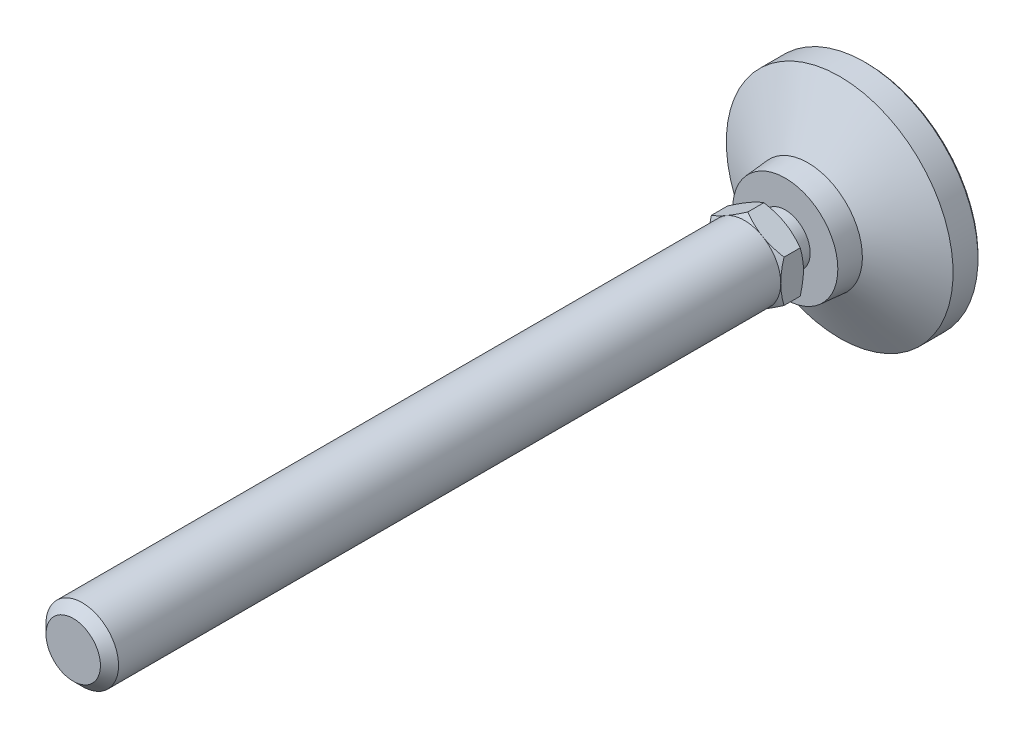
ISO-10303-21;
HEADER;
FILE_DESCRIPTION(('STEP AP214'),'2;1');
FILE_NAME('part.step','',(''),(''),'','','');
FILE_SCHEMA(('AUTOMOTIVE_DESIGN { 1 0 10303 214 1 1 1 1 }'));
ENDSEC;
DATA;
#1=APPLICATION_CONTEXT('core data for automotive mechanical design processes');
#2=APPLICATION_PROTOCOL_DEFINITION('international standard','automotive_design',2000,#1);
#3=PRODUCT_CONTEXT('',#1,'mechanical');
#4=PRODUCT('Part','Part','',(#3));
#5=PRODUCT_RELATED_PRODUCT_CATEGORY('part','',(#4));
#6=PRODUCT_DEFINITION_FORMATION('','',#4);
#7=PRODUCT_DEFINITION_CONTEXT('part definition',#1,'design');
#8=PRODUCT_DEFINITION('design','',#6,#7);
#9=PRODUCT_DEFINITION_SHAPE('','',#8);
#10=(LENGTH_UNIT() NAMED_UNIT(*) SI_UNIT(.MILLI.,.METRE.));
#11=(NAMED_UNIT(*) PLANE_ANGLE_UNIT() SI_UNIT($,.RADIAN.));
#12=(NAMED_UNIT(*) SI_UNIT($,.STERADIAN.) SOLID_ANGLE_UNIT());
#13=UNCERTAINTY_MEASURE_WITH_UNIT(LENGTH_MEASURE(1.E-05),#10,'distance_accuracy_value','');
#14=(GEOMETRIC_REPRESENTATION_CONTEXT(3) GLOBAL_UNCERTAINTY_ASSIGNED_CONTEXT((#13)) GLOBAL_UNIT_ASSIGNED_CONTEXT((#10,
#11,#12)) REPRESENTATION_CONTEXT('',''));
#15=CARTESIAN_POINT('',(0.,0.,0.));
#16=DIRECTION('',(0.,0.,1.));
#17=DIRECTION('',(1.,0.,0.));
#18=AXIS2_PLACEMENT_3D('',#15,#16,#17);
#19=CARTESIAN_POINT('',(0.,-5.50000000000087,21.9999999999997));
#20=DIRECTION('',(0.,0.,-1.));
#21=DIRECTION('',(0.,1.,0.));
#22=AXIS2_PLACEMENT_3D('',#19,#20,#21);
#23=PLANE('',#22);
#24=CARTESIAN_POINT('',(0.,0.,21.9999999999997));
#25=DIRECTION('',(0.,0.,-1.));
#26=DIRECTION('',(0.,1.,0.));
#27=AXIS2_PLACEMENT_3D('',#24,#25,#26);
#28=CIRCLE('',#27,8.00000000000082);
#29=CARTESIAN_POINT('',(-4.00000000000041,6.92820323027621,21.9999999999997));
#30=VERTEX_POINT('',#29);
#31=CARTESIAN_POINT('',(-8.00000000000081,0.,21.9999999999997));
#32=VERTEX_POINT('',#31);
#33=EDGE_CURVE('E9',#30,#32,#28,.F.);
#34=ORIENTED_EDGE('',*,*,#33,.F.);
#35=CARTESIAN_POINT('',(4.,6.92820323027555,21.9999999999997));
#36=VERTEX_POINT('',#35);
#37=EDGE_CURVE('E18',#36,#30,#28,.F.);
#38=ORIENTED_EDGE('',*,*,#37,.F.);
#39=CARTESIAN_POINT('',(8.00000000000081,0.,21.9999999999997));
#40=VERTEX_POINT('',#39);
#41=EDGE_CURVE('E125',#40,#36,#28,.F.);
#42=ORIENTED_EDGE('',*,*,#41,.F.);
#43=CARTESIAN_POINT('',(0.,0.,21.9999999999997));
#44=DIRECTION('',(0.,0.,1.));
#45=DIRECTION('',(0.,-1.,0.));
#46=AXIS2_PLACEMENT_3D('',#43,#44,#45);
#47=CIRCLE('',#46,8.00000000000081);
#48=CARTESIAN_POINT('',(4.00000000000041,-6.92820323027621,21.9999999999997));
#49=VERTEX_POINT('',#48);
#50=EDGE_CURVE('E592',#49,#40,#47,.T.);
#51=ORIENTED_EDGE('',*,*,#50,.F.);
#52=CARTESIAN_POINT('',(-4.00000000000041,-6.92820323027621,21.9999999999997));
#53=VERTEX_POINT('',#52);
#54=EDGE_CURVE('E594',#53,#49,#28,.F.);
#55=ORIENTED_EDGE('',*,*,#54,.F.);
#56=EDGE_CURVE('E23',#32,#53,#28,.F.);
#57=ORIENTED_EDGE('',*,*,#56,.F.);
#58=EDGE_LOOP('',(#34,#38,#42,#51,#55,#57));
#59=FACE_BOUND('',#58,.T.);
#60=CARTESIAN_POINT('',(0.,0.,21.9999999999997));
#61=DIRECTION('',(0.,0.,-1.));
#62=DIRECTION('',(0.,1.,0.));
#63=AXIS2_PLACEMENT_3D('',#60,#61,#62);
#64=CIRCLE('',#63,5.50000000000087);
#65=CARTESIAN_POINT('',(0.,5.50000000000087,21.9999999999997));
#66=VERTEX_POINT('',#65);
#67=EDGE_CURVE('E232',#66,#66,#64,.T.);
#68=ORIENTED_EDGE('',*,*,#67,.F.);
#69=EDGE_LOOP('',(#68));
#70=FACE_BOUND('',#69,.T.);
#71=ADVANCED_FACE('F14',(#59,#70),#23,.T.);
#72=CARTESIAN_POINT('',(0.,0.,-1.));
#73=DIRECTION('',(0.,0.,-1.));
#74=DIRECTION('',(0.,1.,0.));
#75=AXIS2_PLACEMENT_3D('',#72,#73,#74);
#76=CYLINDRICAL_SURFACE('',#75,5.50000000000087);
#77=CARTESIAN_POINT('',(0.,0.,18.));
#78=DIRECTION('',(0.,0.,-1.));
#79=DIRECTION('',(0.,1.,0.));
#80=AXIS2_PLACEMENT_3D('',#77,#78,#79);
#81=CIRCLE('',#80,5.50000000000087);
#82=CARTESIAN_POINT('',(0.,5.50000000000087,18.));
#83=VERTEX_POINT('',#82);
#84=EDGE_CURVE('E235',#83,#83,#81,.T.);
#85=ORIENTED_EDGE('',*,*,#84,.F.);
#86=EDGE_LOOP('',(#85));
#87=FACE_BOUND('',#86,.T.);
#88=ORIENTED_EDGE('',*,*,#67,.T.);
#89=EDGE_LOOP('',(#88));
#90=FACE_BOUND('',#89,.T.);
#91=ADVANCED_FACE('F288',(#87,#90),#76,.T.);
#92=CARTESIAN_POINT('',(0.,-5.50000000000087,18.));
#93=DIRECTION('',(0.,0.,1.));
#94=DIRECTION('',(0.,-1.,0.));
#95=AXIS2_PLACEMENT_3D('',#92,#93,#94);
#96=PLANE('',#95);
#97=ORIENTED_EDGE('',*,*,#84,.T.);
#98=EDGE_LOOP('',(#97));
#99=FACE_BOUND('',#98,.T.);
#100=CARTESIAN_POINT('',(0.,0.,18.));
#101=DIRECTION('',(0.,0.,1.));
#102=DIRECTION('',(0.,-1.,0.));
#103=AXIS2_PLACEMENT_3D('',#100,#101,#102);
#104=CIRCLE('',#103,11.5833333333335);
#105=CARTESIAN_POINT('',(0.,-11.5833333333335,18.));
#106=VERTEX_POINT('',#105);
#107=EDGE_CURVE('E238',#106,#106,#104,.T.);
#108=ORIENTED_EDGE('',*,*,#107,.T.);
#109=EDGE_LOOP('',(#108));
#110=FACE_BOUND('',#109,.T.);
#111=ADVANCED_FACE('F281',(#99,#110),#96,.T.);
#112=CARTESIAN_POINT('',(0.,0.,0.));
#113=DIRECTION('',(0.,0.,-1.));
#114=DIRECTION('',(0.,1.,0.));
#115=AXIS2_PLACEMENT_3D('',#112,#113,#114);
#116=PLANE('',#115);
#117=CARTESIAN_POINT('',(0.,0.,0.));
#118=DIRECTION('',(0.,0.,-1.));
#119=DIRECTION('',(0.,1.,0.));
#120=AXIS2_PLACEMENT_3D('',#117,#118,#119);
#121=CIRCLE('',#120,24.5);
#122=CARTESIAN_POINT('',(0.,24.5,0.));
#123=VERTEX_POINT('',#122);
#124=EDGE_CURVE('E267',#123,#123,#121,.T.);
#125=ORIENTED_EDGE('',*,*,#124,.T.);
#126=EDGE_LOOP('',(#125));
#127=FACE_BOUND('',#126,.T.);
#128=ADVANCED_FACE('F199',(#127),#116,.T.);
#129=CARTESIAN_POINT('',(0.,0.,-1.));
#130=DIRECTION('',(0.,0.,-1.));
#131=DIRECTION('',(0.,1.,0.));
#132=AXIS2_PLACEMENT_3D('',#129,#130,#131);
#133=CYLINDRICAL_SURFACE('',#132,25.);
#134=CARTESIAN_POINT('',(0.,0.,0.500000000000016));
#135=DIRECTION('',(0.,0.,-1.));
#136=DIRECTION('',(0.,1.,0.));
#137=AXIS2_PLACEMENT_3D('',#134,#135,#136);
#138=CIRCLE('',#137,25.);
#139=CARTESIAN_POINT('',(0.,25.,0.500000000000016));
#140=VERTEX_POINT('',#139);
#141=EDGE_CURVE('E126',#140,#140,#138,.F.);
#142=ORIENTED_EDGE('',*,*,#141,.T.);
#143=EDGE_LOOP('',(#142));
#144=FACE_BOUND('',#143,.T.);
#145=CARTESIAN_POINT('',(0.,0.,5.9999999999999));
#146=DIRECTION('',(0.,0.,-1.));
#147=DIRECTION('',(0.,1.,0.));
#148=AXIS2_PLACEMENT_3D('',#145,#146,#147);
#149=CIRCLE('',#148,25.);
#150=CARTESIAN_POINT('',(0.,25.,5.9999999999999));
#151=VERTEX_POINT('',#150);
#152=EDGE_CURVE('E241',#151,#151,#149,.T.);
#153=ORIENTED_EDGE('',*,*,#152,.T.);
#154=EDGE_LOOP('',(#153));
#155=FACE_BOUND('',#154,.T.);
#156=ADVANCED_FACE('F272',(#144,#155),#133,.T.);
#157=CARTESIAN_POINT('',(0.,0.,13.));
#158=DIRECTION('',(0.,0.,-1.));
#159=DIRECTION('',(0.,1.,0.));
#160=AXIS2_PLACEMENT_3D('',#157,#158,#159);
#161=CONICAL_SURFACE('',#160,12.0000000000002,1.07685495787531);
#162=ORIENTED_EDGE('',*,*,#152,.F.);
#163=EDGE_LOOP('',(#162));
#164=FACE_BOUND('',#163,.T.);
#165=CARTESIAN_POINT('',(0.,0.,13.));
#166=DIRECTION('',(0.,0.,-1.));
#167=DIRECTION('',(0.,1.,0.));
#168=AXIS2_PLACEMENT_3D('',#165,#166,#167);
#169=CIRCLE('',#168,12.0000000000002);
#170=CARTESIAN_POINT('',(0.,12.0000000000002,13.));
#171=VERTEX_POINT('',#170);
#172=EDGE_CURVE('E257',#171,#171,#169,.T.);
#173=ORIENTED_EDGE('',*,*,#172,.T.);
#174=EDGE_LOOP('',(#173));
#175=FACE_BOUND('',#174,.T.);
#176=ADVANCED_FACE('F287',(#164,#175),#161,.T.);
#177=CARTESIAN_POINT('',(0.,0.,19.));
#178=DIRECTION('',(0.,0.,-1.));
#179=DIRECTION('',(0.,1.,0.));
#180=AXIS2_PLACEMENT_3D('',#177,#178,#179);
#181=CONICAL_SURFACE('',#180,11.5000000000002,0.0831412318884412);
#182=ORIENTED_EDGE('',*,*,#172,.F.);
#183=EDGE_LOOP('',(#182));
#184=FACE_BOUND('',#183,.T.);
#185=ORIENTED_EDGE('',*,*,#107,.F.);
#186=EDGE_LOOP('',(#185));
#187=FACE_BOUND('',#186,.T.);
#188=ADVANCED_FACE('F277',(#184,#187),#181,.T.);
#189=CARTESIAN_POINT('',(0.,0.,0.));
#190=DIRECTION('',(0.,0.,1.));
#191=DIRECTION('',(0.,-1.,0.));
#192=AXIS2_PLACEMENT_3D('',#189,#190,#191);
#193=CONICAL_SURFACE('',#192,24.5,0.785398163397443);
#194=ORIENTED_EDGE('',*,*,#141,.F.);
#195=EDGE_LOOP('',(#194));
#196=FACE_BOUND('',#195,.T.);
#197=ORIENTED_EDGE('',*,*,#124,.F.);
#198=EDGE_LOOP('',(#197));
#199=FACE_BOUND('',#198,.T.);
#200=ADVANCED_FACE('F16',(#196,#199),#193,.T.);
#201=CARTESIAN_POINT('',(0.,0.,21.9999999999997));
#202=DIRECTION('',(0.,0.,1.));
#203=DIRECTION('',(0.,-1.,0.));
#204=AXIS2_PLACEMENT_3D('',#201,#202,#203);
#205=CONICAL_SURFACE('',#204,8.00000000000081,1.0471975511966);
#206=CARTESIAN_POINT('',(-8.0002,4.61868668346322,22.7145978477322));
#207=CARTESIAN_POINT('',(-7.8243512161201,4.72021302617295,22.6559907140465));
#208=CARTESIAN_POINT('',(-7.64784680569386,4.8221178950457,22.6000434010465));
#209=CARTESIAN_POINT('',(-7.29340453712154,5.02675523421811,22.4942010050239));
#210=CARTESIAN_POINT('',(-7.11546609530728,5.12948804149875,22.4443085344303));
#211=CARTESIAN_POINT('',(-6.57880176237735,5.43933133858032,22.3046927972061));
#212=CARTESIAN_POINT('',(-6.21795741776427,5.64766491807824,22.2252811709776));
#213=CARTESIAN_POINT('',(-5.67796082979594,5.95943209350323,22.1321616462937));
#214=CARTESIAN_POINT('',(-5.50042181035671,6.06193429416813,22.1056345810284));
#215=CARTESIAN_POINT('',(-5.14454088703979,6.26740224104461,22.0611531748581));
#216=CARTESIAN_POINT('',(-4.96619905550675,6.37036794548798,22.0431980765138));
#217=CARTESIAN_POINT('',(-4.6092083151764,6.57647664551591,22.0163156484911));
#218=CARTESIAN_POINT('',(-4.43055998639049,6.67961930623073,22.0073780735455));
#219=CARTESIAN_POINT('',(-4.07309829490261,6.88599991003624,21.9987223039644));
#220=CARTESIAN_POINT('',(-3.89428493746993,6.9892378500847,21.9990038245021));
#221=CARTESIAN_POINT('',(-3.55998663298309,7.18224506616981,22.008145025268));
#222=CARTESIAN_POINT('',(-3.40447809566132,7.27202796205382,22.0158896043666));
#223=CARTESIAN_POINT('',(-3.09382523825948,7.45138347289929,22.0382011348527));
#224=CARTESIAN_POINT('',(-2.93868094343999,7.54095607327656,22.0527685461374));
#225=CARTESIAN_POINT('',(-2.47384868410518,7.80932710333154,22.1063606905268));
#226=CARTESIAN_POINT('',(-2.16498351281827,7.98765049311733,22.1552686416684));
#227=CARTESIAN_POINT('',(-1.54397677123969,8.3461889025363,22.2775394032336));
#228=CARTESIAN_POINT('',(-1.23191445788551,8.52635816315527,22.3514205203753));
#229=CARTESIAN_POINT('',(-0.61244351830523,8.8840098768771,22.5191001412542));
#230=CARTESIAN_POINT('',(-0.305026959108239,9.06149691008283,22.6128592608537));
#231=CARTESIAN_POINT('',(0.000200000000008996,9.23771977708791,22.7145978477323));
#232=B_SPLINE_CURVE_WITH_KNOTS('',3,(#206,#207,#208,#209,#210,#211,#212,#213,#214,#215,#216,
#217,#218,#219,#220,#221,#222,#223,#224,#225,#226,#227,#228,#229,#230,#231),.UNSPECIFIED.,.F.,
.F.,(4,2,2,2,2,2,2,2,2,2,2,2,4),(0.,0.633973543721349,1.26821965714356,2.53934712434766,
3.15934343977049,3.77928496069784,4.39852133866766,5.01773858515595,5.55680239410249,
6.09590254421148,7.17487077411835,8.27776850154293,9.37850115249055),.UNSPECIFIED.);
#233=CARTESIAN_POINT('',(0.,9.23760430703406,22.7145311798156));
#234=VERTEX_POINT('',#233);
#235=EDGE_CURVE('E115',#30,#234,#232,.T.);
#236=ORIENTED_EDGE('',*,*,#235,.T.);
#237=CARTESIAN_POINT('',(-0.000199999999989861,9.2377197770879,22.7145978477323));
#238=CARTESIAN_POINT('',(0.175648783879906,9.13619343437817,22.6559907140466));
#239=CARTESIAN_POINT('',(0.352153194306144,9.03428856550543,22.6000434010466));
#240=CARTESIAN_POINT('',(0.70659546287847,8.82965122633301,22.4942010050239));
#241=CARTESIAN_POINT('',(0.884533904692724,8.72691841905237,22.4443085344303));
#242=CARTESIAN_POINT('',(1.42119823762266,8.4170751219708,22.3046927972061));
#243=CARTESIAN_POINT('',(1.78204258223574,8.20874154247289,22.2252811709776));
#244=CARTESIAN_POINT('',(2.32203917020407,7.89697436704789,22.1321616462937));
#245=CARTESIAN_POINT('',(2.49957818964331,7.79447216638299,22.1056345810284));
#246=CARTESIAN_POINT('',(2.85545911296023,7.58900421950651,22.0611531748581));
#247=CARTESIAN_POINT('',(3.03380094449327,7.48603851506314,22.0431980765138));
#248=CARTESIAN_POINT('',(3.39079168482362,7.27992981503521,22.0163156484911));
#249=CARTESIAN_POINT('',(3.56944001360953,7.17678715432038,22.0073780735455));
#250=CARTESIAN_POINT('',(3.92690170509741,6.97040655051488,21.9987223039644));
#251=CARTESIAN_POINT('',(4.1057150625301,6.86716861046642,21.9990038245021));
#252=CARTESIAN_POINT('',(4.44001336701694,6.67416139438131,22.008145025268));
#253=CARTESIAN_POINT('',(4.5955219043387,6.5843784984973,22.0158896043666));
#254=CARTESIAN_POINT('',(4.90617476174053,6.40502298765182,22.0382011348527));
#255=CARTESIAN_POINT('',(5.06131905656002,6.31545038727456,22.0527685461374));
#256=CARTESIAN_POINT('',(5.52615131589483,6.04707935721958,22.1063606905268));
#257=CARTESIAN_POINT('',(5.83501648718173,5.86875596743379,22.1552686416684));
#258=CARTESIAN_POINT('',(6.4560232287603,5.51021755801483,22.2775394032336));
#259=CARTESIAN_POINT('',(6.76808554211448,5.33004829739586,22.3514205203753));
#260=CARTESIAN_POINT('',(7.38755648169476,4.97239658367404,22.5191001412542));
#261=CARTESIAN_POINT('',(7.69497304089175,4.79490955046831,22.6128592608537));
#262=CARTESIAN_POINT('',(8.0002,4.61868668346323,22.7145978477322));
#263=B_SPLINE_CURVE_WITH_KNOTS('',3,(#237,#238,#239,#240,#241,#242,#243,#244,#245,#246,#247,
#248,#249,#250,#251,#252,#253,#254,#255,#256,#257,#258,#259,#260,#261,#262),.UNSPECIFIED.,.F.,
.F.,(4,2,2,2,2,2,2,2,2,2,2,2,4),(0.,0.633973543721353,1.26821965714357,2.53934712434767,
3.15934343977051,3.77928496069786,4.39852133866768,5.01773858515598,5.55680239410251,
6.09590254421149,7.17487077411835,8.27776850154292,9.37850115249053),.UNSPECIFIED.);
#264=EDGE_CURVE('E121',#234,#36,#263,.T.);
#265=ORIENTED_EDGE('',*,*,#264,.T.);
#266=ORIENTED_EDGE('',*,*,#37,.T.);
#267=EDGE_LOOP('',(#236,#265,#266));
#268=FACE_BOUND('',#267,.T.);
#269=ADVANCED_FACE('F119',(#268),#205,.T.);
#270=CARTESIAN_POINT('',(8.,12.3789060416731,25.890747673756));
#271=CARTESIAN_POINT('',(8.,12.0297316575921,25.7214786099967));
#272=CARTESIAN_POINT('',(8.,11.6797527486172,25.5538405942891));
#273=CARTESIAN_POINT('',(8.,10.9777579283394,25.2227445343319));
#274=CARTESIAN_POINT('',(8.,10.6257417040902,25.0592871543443));
#275=CARTESIAN_POINT('',(8.,9.91741719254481,24.7366419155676));
#276=CARTESIAN_POINT('',(8.,9.5610959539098,24.5774823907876));
#277=CARTESIAN_POINT('',(8.,8.84560981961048,24.2657136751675));
#278=CARTESIAN_POINT('',(8.,8.48644506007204,24.1131041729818));
#279=CARTESIAN_POINT('',(8.,7.75320140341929,23.8114348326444));
#280=CARTESIAN_POINT('',(8.,7.37901174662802,23.6626427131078));
#281=CARTESIAN_POINT('',(8.,6.62624528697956,23.3763869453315));
#282=CARTESIAN_POINT('',(8.,6.24766799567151,23.2389245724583));
#283=CARTESIAN_POINT('',(8.,5.48623705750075,22.9789578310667));
#284=CARTESIAN_POINT('',(8.,5.10339394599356,22.8564229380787));
#285=CARTESIAN_POINT('',(8.,4.33222994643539,22.630259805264));
#286=CARTESIAN_POINT('',(8.,3.94391083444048,22.5266255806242));
#287=CARTESIAN_POINT('',(8.,3.16366689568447,22.3438140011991));
#288=CARTESIAN_POINT('',(8.,2.77177385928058,22.2645046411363));
#289=CARTESIAN_POINT('',(8.,2.1803878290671,22.1672300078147));
#290=CARTESIAN_POINT('',(8.,1.9826533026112,22.1384187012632));
#291=CARTESIAN_POINT('',(8.,1.58621087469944,22.088591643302));
#292=CARTESIAN_POINT('',(8.,1.38750306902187,22.0675751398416));
#293=CARTESIAN_POINT('',(8.,0.991963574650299,22.0340185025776));
#294=CARTESIAN_POINT('',(8.,0.795140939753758,22.0213720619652));
#295=CARTESIAN_POINT('',(8.,0.401137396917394,22.0044118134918));
#296=CARTESIAN_POINT('',(8.,0.20395649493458,22.0000978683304));
#297=CARTESIAN_POINT('',(8.,-0.190411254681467,21.9999054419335));
#298=CARTESIAN_POINT('',(8.,-0.387598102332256,22.0040269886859));
#299=CARTESIAN_POINT('',(8.,-0.781623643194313,22.0206052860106));
#300=CARTESIAN_POINT('',(8.,-0.978462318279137,22.0330624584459));
#301=CARTESIAN_POINT('',(8.,-1.45238232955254,22.0728273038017));
#302=CARTESIAN_POINT('',(8.,-1.7291348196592,22.1041375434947));
#303=CARTESIAN_POINT('',(8.,-2.28055433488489,22.1815210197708));
#304=CARTESIAN_POINT('',(8.,-2.55522106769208,22.2275962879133));
#305=CARTESIAN_POINT('',(8.,-3.3757971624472,22.3855237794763));
#306=CARTESIAN_POINT('',(8.,-3.91796881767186,22.517047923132));
#307=CARTESIAN_POINT('',(8.,-4.72859747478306,22.7447233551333));
#308=CARTESIAN_POINT('',(8.,-5.00126963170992,22.8267266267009));
#309=CARTESIAN_POINT('',(8.,-5.54396501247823,22.9991521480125));
#310=CARTESIAN_POINT('',(8.,-5.81398821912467,23.0895744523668));
#311=CARTESIAN_POINT('',(8.,-6.3514722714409,23.2773954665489));
#312=CARTESIAN_POINT('',(8.,-6.61893395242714,23.3747918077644));
#313=CARTESIAN_POINT('',(8.,-7.151648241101,23.5754247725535));
#314=CARTESIAN_POINT('',(8.,-7.41690087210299,23.6786613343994));
#315=CARTESIAN_POINT('',(8.,-8.03215461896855,23.924676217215));
#316=CARTESIAN_POINT('',(8.,-8.38141006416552,24.0693156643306));
#317=CARTESIAN_POINT('',(8.,-9.07703169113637,24.36540229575));
#318=CARTESIAN_POINT('',(8.,-9.42339770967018,24.516849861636));
#319=CARTESIAN_POINT('',(8.,-10.1137569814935,24.8252167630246));
#320=CARTESIAN_POINT('',(8.,-10.4577497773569,24.982137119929));
#321=CARTESIAN_POINT('',(8.,-11.1436966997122,25.30037981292));
#322=CARTESIAN_POINT('',(8.,-11.4856507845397,25.4617022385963));
#323=CARTESIAN_POINT('',(8.,-12.1681853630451,25.7881024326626));
#324=CARTESIAN_POINT('',(8.,-12.5087641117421,25.9531838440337));
#325=CARTESIAN_POINT('',(8.,-13.1884668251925,26.2863176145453));
#326=CARTESIAN_POINT('',(8.,-13.5275907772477,26.4543699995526));
#327=CARTESIAN_POINT('',(8.,-14.5430364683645,26.9621670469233));
#328=CARTESIAN_POINT('',(8.,-15.2175173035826,27.3055927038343));
#329=CARTESIAN_POINT('',(8.,-16.5081876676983,27.9711854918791));
#330=CARTESIAN_POINT('',(8.,-17.1246578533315,28.2928107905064));
#331=CARTESIAN_POINT('',(8.,-18.3552851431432,28.9405020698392));
#332=CARTESIAN_POINT('',(8.,-18.9694421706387,29.2665681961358));
#333=CARTESIAN_POINT('',(8.,-20.1944810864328,29.9213120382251));
#334=CARTESIAN_POINT('',(8.,-20.8053672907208,30.2499816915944));
#335=CARTESIAN_POINT('',(8.,-22.0256539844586,30.9099920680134));
#336=CARTESIAN_POINT('',(8.,-22.6350545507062,31.2413326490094));
#337=CARTESIAN_POINT('',(8.,-23.2439051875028,31.573673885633));
#338=B_SPLINE_CURVE_WITH_KNOTS('',3,(#270,#271,#272,#273,#274,#275,#276,#277,#278,#279,#280,
#281,#282,#283,#284,#285,#286,#287,#288,#289,#290,#291,#292,#293,#294,#295,#296,#297,#298,#299,
#300,#301,#302,#303,#304,#305,#306,#307,#308,#309,#310,#311,#312,#313,#314,#315,#316,#317,#318,
#319,#320,#321,#322,#323,#324,#325,#326,#327,#328,#329,#330,#331,#332,#333,#334,#335,#336,#337),
.UNSPECIFIED.,.F.,.F.,(4,2,2,2,2,2,2,2,2,2,2,2,2,2,2,2,2,2,2,2,2,2,2,2,2,2,2,2,2,2,2,2,2,4),(0.,
1.16413328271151,2.32845039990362,3.49915341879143,4.66980072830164,5.87772003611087,
7.08577513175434,8.29131692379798,9.49647632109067,10.6949749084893,11.2943129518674,
11.8935931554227,12.4851079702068,13.0766130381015,13.6681200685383,14.2596570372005,
15.0947384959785,15.9299349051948,17.6012685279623,18.4554067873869,19.3095505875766,
20.1634056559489,21.0172517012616,22.1512188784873,23.2852496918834,24.419493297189,
25.553760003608,26.6891771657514,27.8246042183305,30.0951744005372,32.1811332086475,
34.2671605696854,36.3482232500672,38.4291759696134),.UNSPECIFIED.);
#339=CARTESIAN_POINT('',(8.,4.61880215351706,22.7145311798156));
#340=VERTEX_POINT('',#339);
#341=EDGE_CURVE('E134',#340,#40,#338,.T.);
#342=ORIENTED_EDGE('',*,*,#341,.T.);
#343=ORIENTED_EDGE('',*,*,#41,.T.);
#344=EDGE_CURVE('E171',#36,#340,#263,.T.);
#345=ORIENTED_EDGE('',*,*,#344,.T.);
#346=EDGE_LOOP('',(#342,#343,#345));
#347=FACE_BOUND('',#346,.T.);
#348=ADVANCED_FACE('F159',(#347),#205,.T.);
#349=CARTESIAN_POINT('',(8.0002,-4.61868668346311,22.7145978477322));
#350=CARTESIAN_POINT('',(7.82435121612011,-4.72021302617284,22.6559907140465));
#351=CARTESIAN_POINT('',(7.64784680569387,-4.82211789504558,22.6000434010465));
#352=CARTESIAN_POINT('',(7.29340453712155,-5.02675523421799,22.4942010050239));
#353=CARTESIAN_POINT('',(7.11546609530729,-5.12948804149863,22.4443085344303));
#354=CARTESIAN_POINT('',(6.57880176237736,-5.4393313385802,22.3046927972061));
#355=CARTESIAN_POINT('',(6.21795741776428,-5.64766491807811,22.2252811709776));
#356=CARTESIAN_POINT('',(5.67796082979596,-5.95943209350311,22.1321616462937));
#357=CARTESIAN_POINT('',(5.50042181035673,-6.06193429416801,22.1056345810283));
#358=CARTESIAN_POINT('',(5.14454088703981,-6.26740224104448,22.0611531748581));
#359=CARTESIAN_POINT('',(4.96619905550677,-6.37036794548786,22.0431980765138));
#360=CARTESIAN_POINT('',(4.60920831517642,-6.57647664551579,22.0163156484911));
#361=CARTESIAN_POINT('',(4.43055998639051,-6.67961930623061,22.0073780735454));
#362=CARTESIAN_POINT('',(4.07309829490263,-6.88599991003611,21.9987223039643));
#363=CARTESIAN_POINT('',(3.89428493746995,-6.98923785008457,21.999003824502));
#364=CARTESIAN_POINT('',(3.55998663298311,-7.18224506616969,22.008145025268));
#365=CARTESIAN_POINT('',(3.40447809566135,-7.27202796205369,22.0158896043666));
#366=CARTESIAN_POINT('',(3.09382523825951,-7.45138347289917,22.0382011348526));
#367=CARTESIAN_POINT('',(2.93868094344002,-7.54095607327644,22.0527685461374));
#368=CARTESIAN_POINT('',(2.4738486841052,-7.80932710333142,22.1063606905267));
#369=CARTESIAN_POINT('',(2.16498351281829,-7.98765049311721,22.1552686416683));
#370=CARTESIAN_POINT('',(1.54397677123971,-8.34618890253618,22.2775394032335));
#371=CARTESIAN_POINT('',(1.23191445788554,-8.52635816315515,22.3514205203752));
#372=CARTESIAN_POINT('',(0.612443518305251,-8.88400987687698,22.5191001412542));
#373=CARTESIAN_POINT('',(0.305026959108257,-9.06149691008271,22.6128592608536));
#374=CARTESIAN_POINT('',(-0.000199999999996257,-9.23771977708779,22.7145978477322));
#375=B_SPLINE_CURVE_WITH_KNOTS('',3,(#349,#350,#351,#352,#353,#354,#355,#356,#357,#358,#359,
#360,#361,#362,#363,#364,#365,#366,#367,#368,#369,#370,#371,#372,#373,#374),.UNSPECIFIED.,.F.,
.F.,(4,2,2,2,2,2,2,2,2,2,2,2,4),(0.,0.63397354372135,1.26821965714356,2.53934712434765,
3.15934343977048,3.77928496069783,4.39852133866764,5.01773858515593,5.55680239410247,
6.09590254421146,7.17487077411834,8.27776850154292,9.37850115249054),.UNSPECIFIED.);
#376=CARTESIAN_POINT('',(8.,-4.61880215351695,22.7145311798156));
#377=VERTEX_POINT('',#376);
#378=EDGE_CURVE('E149',#377,#49,#375,.T.);
#379=ORIENTED_EDGE('',*,*,#378,.T.);
#380=ORIENTED_EDGE('',*,*,#50,.T.);
#381=EDGE_CURVE('E114',#40,#377,#338,.T.);
#382=ORIENTED_EDGE('',*,*,#381,.T.);
#383=EDGE_LOOP('',(#379,#380,#382));
#384=FACE_BOUND('',#383,.T.);
#385=ADVANCED_FACE('F163',(#384),#205,.T.);
#386=CARTESIAN_POINT('',(0.00020000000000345,-9.23771977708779,22.7145978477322));
#387=CARTESIAN_POINT('',(-0.175648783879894,-9.13619343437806,22.6559907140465));
#388=CARTESIAN_POINT('',(-0.352153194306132,-9.03428856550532,22.6000434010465));
#389=CARTESIAN_POINT('',(-0.706595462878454,-8.8296512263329,22.4942010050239));
#390=CARTESIAN_POINT('',(-0.884533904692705,-8.72691841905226,22.4443085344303));
#391=CARTESIAN_POINT('',(-1.42119823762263,-8.4170751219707,22.3046927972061));
#392=CARTESIAN_POINT('',(-1.78204258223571,-8.20874154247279,22.2252811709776));
#393=CARTESIAN_POINT('',(-2.32203917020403,-7.8969743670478,22.1321616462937));
#394=CARTESIAN_POINT('',(-2.49957818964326,-7.79447216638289,22.1056345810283));
#395=CARTESIAN_POINT('',(-2.85545911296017,-7.58900421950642,22.0611531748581));
#396=CARTESIAN_POINT('',(-3.03380094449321,-7.48603851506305,22.0431980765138));
#397=CARTESIAN_POINT('',(-3.39079168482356,-7.27992981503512,22.0163156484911));
#398=CARTESIAN_POINT('',(-3.56944001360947,-7.1767871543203,22.0073780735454));
#399=CARTESIAN_POINT('',(-3.92690170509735,-6.97040655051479,21.9987223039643));
#400=CARTESIAN_POINT('',(-4.10571506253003,-6.86716861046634,21.999003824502));
#401=CARTESIAN_POINT('',(-4.44001336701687,-6.67416139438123,22.008145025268));
#402=CARTESIAN_POINT('',(-4.59552190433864,-6.58437849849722,22.0158896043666));
#403=CARTESIAN_POINT('',(-4.90617476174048,-6.40502298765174,22.0382011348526));
#404=CARTESIAN_POINT('',(-5.06131905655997,-6.31545038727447,22.0527685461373));
#405=CARTESIAN_POINT('',(-5.52615131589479,-6.04707935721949,22.1063606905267));
#406=CARTESIAN_POINT('',(-5.8350164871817,-5.86875596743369,22.1552686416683));
#407=CARTESIAN_POINT('',(-6.45602322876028,-5.51021755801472,22.2775394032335));
#408=CARTESIAN_POINT('',(-6.76808554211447,-5.33004829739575,22.3514205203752));
#409=CARTESIAN_POINT('',(-7.38755648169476,-4.97239658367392,22.5191001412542));
#410=CARTESIAN_POINT('',(-7.69497304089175,-4.79490955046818,22.6128592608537));
#411=CARTESIAN_POINT('',(-8.0002,-4.6186866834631,22.7145978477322));
#412=B_SPLINE_CURVE_WITH_KNOTS('',3,(#386,#387,#388,#389,#390,#391,#392,#393,#394,#395,#396,
#397,#398,#399,#400,#401,#402,#403,#404,#405,#406,#407,#408,#409,#410,#411),.UNSPECIFIED.,.F.,
.F.,(4,2,2,2,2,2,2,2,2,2,2,2,4),(0.,0.633973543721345,1.26821965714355,2.53934712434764,
3.15934343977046,3.7792849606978,4.39852133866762,5.01773858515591,5.55680239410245,
6.09590254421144,7.17487077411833,8.27776850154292,9.37850115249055),.UNSPECIFIED.);
#413=CARTESIAN_POINT('',(0.,-9.23760430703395,22.7145311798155));
#414=VERTEX_POINT('',#413);
#415=EDGE_CURVE('E37',#414,#53,#412,.T.);
#416=ORIENTED_EDGE('',*,*,#415,.T.);
#417=ORIENTED_EDGE('',*,*,#54,.T.);
#418=EDGE_CURVE('E536',#49,#414,#375,.T.);
#419=ORIENTED_EDGE('',*,*,#418,.T.);
#420=EDGE_LOOP('',(#416,#417,#419));
#421=FACE_BOUND('',#420,.T.);
#422=ADVANCED_FACE('F165',(#421),#205,.T.);
#423=CARTESIAN_POINT('',(-8.,-4.61880215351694,22.7145311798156));
#424=VERTEX_POINT('',#423);
#425=EDGE_CURVE('E186',#53,#424,#412,.T.);
#426=ORIENTED_EDGE('',*,*,#425,.T.);
#427=CARTESIAN_POINT('',(-8.,12.3789060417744,25.8907476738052));
#428=CARTESIAN_POINT('',(-8.,12.0297316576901,25.7214786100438));
#429=CARTESIAN_POINT('',(-8.00000000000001,11.6797527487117,25.5538405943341));
#430=CARTESIAN_POINT('',(-8.00000000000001,10.9777579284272,25.2227445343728));
#431=CARTESIAN_POINT('',(-8.00000000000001,10.6257417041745,25.0592871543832));
#432=CARTESIAN_POINT('',(-8.00000000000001,9.91741719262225,24.7366419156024));
#433=CARTESIAN_POINT('',(-8.00000000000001,9.56109595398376,24.5774823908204));
#434=CARTESIAN_POINT('',(-8.00000000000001,8.84560981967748,24.2657136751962));
#435=CARTESIAN_POINT('',(-8.00000000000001,8.48644506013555,24.1131041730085));
#436=CARTESIAN_POINT('',(-8.00000000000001,7.75320140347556,23.811434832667));
#437=CARTESIAN_POINT('',(-8.00000000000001,7.37901174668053,23.6626427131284));
#438=CARTESIAN_POINT('',(-8.00000000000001,6.62624528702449,23.376386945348));
#439=CARTESIAN_POINT('',(-8.,6.24766799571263,23.2389245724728));
#440=CARTESIAN_POINT('',(-8.,5.48623705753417,22.9789578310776));
#441=CARTESIAN_POINT('',(-8.00000000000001,5.10339394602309,22.8564229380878));
#442=CARTESIAN_POINT('',(-8.,4.33222994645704,22.6302598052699));
#443=CARTESIAN_POINT('',(-8.,3.94391083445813,22.5266255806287));
#444=CARTESIAN_POINT('',(-8.,3.16366689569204,22.3438140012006));
#445=CARTESIAN_POINT('',(-8.,2.77177385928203,22.2645046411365));
#446=CARTESIAN_POINT('',(-8.,2.18038782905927,22.1672300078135));
#447=CARTESIAN_POINT('',(-8.,1.98265330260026,22.1384187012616));
#448=CARTESIAN_POINT('',(-8.,1.58621087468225,22.0885916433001));
#449=CARTESIAN_POINT('',(-8.,1.38750306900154,22.0675751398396));
#450=CARTESIAN_POINT('',(-8.,0.991963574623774,22.0340185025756));
#451=CARTESIAN_POINT('',(-8.,0.795140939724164,22.0213720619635));
#452=CARTESIAN_POINT('',(-8.,0.401137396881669,22.0044118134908));
#453=CARTESIAN_POINT('',(-8.,0.203956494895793,22.0000978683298));
#454=CARTESIAN_POINT('',(-8.,-0.190411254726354,21.9999054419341));
#455=CARTESIAN_POINT('',(-8.,-0.38759810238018,22.0040269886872));
#456=CARTESIAN_POINT('',(-8.,-0.781623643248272,22.0206052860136));
#457=CARTESIAN_POINT('',(-8.,-0.978462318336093,22.0330624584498));
#458=CARTESIAN_POINT('',(-8.,-1.4523823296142,22.072827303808));
#459=CARTESIAN_POINT('',(-8.,-1.72913481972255,22.1041375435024));
#460=CARTESIAN_POINT('',(-8.,-2.28055433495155,22.1815210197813));
#461=CARTESIAN_POINT('',(-8.,-2.55522106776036,22.2275962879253));
#462=CARTESIAN_POINT('',(-8.,-3.37579716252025,22.3855237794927));
#463=CARTESIAN_POINT('',(-8.,-3.91796881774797,22.5170479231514));
#464=CARTESIAN_POINT('',(-8.,-4.72859747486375,22.744723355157));
#465=CARTESIAN_POINT('',(-8.,-5.00126963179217,22.8267266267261));
#466=CARTESIAN_POINT('',(-8.,-5.54396501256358,22.9991521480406));
#467=CARTESIAN_POINT('',(-8.,-5.81398821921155,23.0895744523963));
#468=CARTESIAN_POINT('',(-8.,-6.35147227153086,23.2773954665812));
#469=CARTESIAN_POINT('',(-8.,-6.61893395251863,23.3747918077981));
#470=CARTESIAN_POINT('',(-8.,-7.15164824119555,23.5754247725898));
#471=CARTESIAN_POINT('',(-8.,-7.41690087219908,23.6786613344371));
#472=CARTESIAN_POINT('',(-8.,-8.03215461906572,23.9246762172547));
#473=CARTESIAN_POINT('',(-8.,-8.38141006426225,24.0693156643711));
#474=CARTESIAN_POINT('',(-8.,-9.0770316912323,24.3654022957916));
#475=CARTESIAN_POINT('',(-8.,-9.42339770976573,24.5168498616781));
#476=CARTESIAN_POINT('',(-8.,-10.1137569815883,24.8252167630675));
#477=CARTESIAN_POINT('',(-8.,-10.4577497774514,24.9821371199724));
#478=CARTESIAN_POINT('',(-8.,-11.143696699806,25.300379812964));
#479=CARTESIAN_POINT('',(-8.,-11.4856507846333,25.4617022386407));
#480=CARTESIAN_POINT('',(-8.,-12.1681853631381,25.7881024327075));
#481=CARTESIAN_POINT('',(-8.,-12.5087641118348,25.9531838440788));
#482=CARTESIAN_POINT('',(-8.,-13.1884668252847,26.2863176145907));
#483=CARTESIAN_POINT('',(-8.,-13.5275907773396,26.4543699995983));
#484=CARTESIAN_POINT('',(-8.,-14.5430364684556,26.9621670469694));
#485=CARTESIAN_POINT('',(-8.,-15.2175173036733,27.3055927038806));
#486=CARTESIAN_POINT('',(-8.,-16.5081876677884,27.971185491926));
#487=CARTESIAN_POINT('',(-7.99999999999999,-17.1246578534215,28.2928107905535));
#488=CARTESIAN_POINT('',(-7.99999999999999,-18.3552851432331,28.9405020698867));
#489=CARTESIAN_POINT('',(-7.99999999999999,-18.9694421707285,29.2665681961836));
#490=CARTESIAN_POINT('',(-7.99999999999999,-20.1944810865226,29.9213120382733));
#491=CARTESIAN_POINT('',(-7.99999999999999,-20.8053672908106,30.2499816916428));
#492=CARTESIAN_POINT('',(-7.99999999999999,-22.0256539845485,30.9099920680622));
#493=CARTESIAN_POINT('',(-7.99999999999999,-22.6350545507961,31.2413326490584));
#494=CARTESIAN_POINT('',(-8.,-23.2439051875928,31.5736738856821));
#495=B_SPLINE_CURVE_WITH_KNOTS('',3,(#427,#428,#429,#430,#431,#432,#433,#434,#435,#436,#437,
#438,#439,#440,#441,#442,#443,#444,#445,#446,#447,#448,#449,#450,#451,#452,#453,#454,#455,#456,
#457,#458,#459,#460,#461,#462,#463,#464,#465,#466,#467,#468,#469,#470,#471,#472,#473,#474,#475,
#476,#477,#478,#479,#480,#481,#482,#483,#484,#485,#486,#487,#488,#489,#490,#491,#492,#493,#494),
.UNSPECIFIED.,.F.,.F.,(4,2,2,2,2,2,2,2,2,2,2,2,2,2,2,2,2,2,2,2,2,2,2,2,2,2,2,2,2,2,2,2,2,4),(0.,
1.1641332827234,2.32845039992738,3.49915341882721,4.66980072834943,5.8777200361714,
7.08577513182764,8.29131692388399,9.49647632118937,10.6949749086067,11.2943129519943,
11.8935931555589,12.4851079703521,13.076613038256,13.6681200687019,14.2596570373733,
15.0947384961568,15.9299349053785,17.6012685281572,18.4554067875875,19.3095505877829,
20.1634056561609,21.0172517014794,22.1512188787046,23.2852496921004,24.4194932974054,
25.553760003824,26.6891771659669,27.8246042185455,30.0951744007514,32.1811332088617,
34.2671605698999,36.348223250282,38.4291759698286),.UNSPECIFIED.);
#496=EDGE_CURVE('E30',#424,#32,#495,.F.);
#497=ORIENTED_EDGE('',*,*,#496,.T.);
#498=ORIENTED_EDGE('',*,*,#56,.T.);
#499=EDGE_LOOP('',(#426,#497,#498));
#500=FACE_BOUND('',#499,.T.);
#501=ADVANCED_FACE('F373',(#500),#205,.T.);
#502=CARTESIAN_POINT('',(-8.,4.61880215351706,22.7145311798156));
#503=VERTEX_POINT('',#502);
#504=EDGE_CURVE('E109',#32,#503,#495,.F.);
#505=ORIENTED_EDGE('',*,*,#504,.T.);
#506=EDGE_CURVE('E103',#503,#30,#232,.T.);
#507=ORIENTED_EDGE('',*,*,#506,.T.);
#508=ORIENTED_EDGE('',*,*,#33,.T.);
#509=EDGE_LOOP('',(#505,#507,#508));
#510=FACE_BOUND('',#509,.T.);
#511=ADVANCED_FACE('F105',(#510),#205,.T.);
#512=CARTESIAN_POINT('',(0.,0.,175.));
#513=DIRECTION('',(0.,0.,-1.));
#514=DIRECTION('',(0.,1.,0.));
#515=AXIS2_PLACEMENT_3D('',#512,#513,#514);
#516=PLANE('',#515);
#517=CARTESIAN_POINT('',(0.,0.,175.));
#518=DIRECTION('',(0.,0.,-1.));
#519=DIRECTION('',(0.,1.,0.));
#520=AXIS2_PLACEMENT_3D('',#517,#518,#519);
#521=CIRCLE('',#520,6.00000000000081);
#522=CARTESIAN_POINT('',(0.,6.00000000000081,175.));
#523=VERTEX_POINT('',#522);
#524=EDGE_CURVE('E229',#523,#523,#521,.T.);
#525=ORIENTED_EDGE('',*,*,#524,.F.);
#526=EDGE_LOOP('',(#525));
#527=FACE_BOUND('',#526,.T.);
#528=ADVANCED_FACE('F298',(#527),#516,.F.);
#529=CARTESIAN_POINT('',(0.,0.,175.));
#530=DIRECTION('',(0.,0.,-1.));
#531=DIRECTION('',(0.,1.,0.));
#532=AXIS2_PLACEMENT_3D('',#529,#530,#531);
#533=CONICAL_SURFACE('',#532,6.00000000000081,0.785398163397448);
#534=CARTESIAN_POINT('',(0.,0.,173.));
#535=DIRECTION('',(0.,0.,-1.));
#536=DIRECTION('',(0.,1.,0.));
#537=AXIS2_PLACEMENT_3D('',#534,#535,#536);
#538=CIRCLE('',#537,8.00000000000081);
#539=CARTESIAN_POINT('',(0.,8.00000000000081,173.));
#540=VERTEX_POINT('',#539);
#541=EDGE_CURVE('E226',#540,#540,#538,.T.);
#542=ORIENTED_EDGE('',*,*,#541,.F.);
#543=EDGE_LOOP('',(#542));
#544=FACE_BOUND('',#543,.T.);
#545=ORIENTED_EDGE('',*,*,#524,.T.);
#546=EDGE_LOOP('',(#545));
#547=FACE_BOUND('',#546,.T.);
#548=ADVANCED_FACE('F300',(#544,#547),#533,.T.);
#549=CARTESIAN_POINT('',(0.,0.,-1.));
#550=DIRECTION('',(0.,0.,-1.));
#551=DIRECTION('',(0.,1.,0.));
#552=AXIS2_PLACEMENT_3D('',#549,#550,#551);
#553=CYLINDRICAL_SURFACE('',#552,8.00000000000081);
#554=CARTESIAN_POINT('',(0.,0.,27.));
#555=DIRECTION('',(0.,0.,1.));
#556=DIRECTION('',(0.,-1.,0.));
#557=AXIS2_PLACEMENT_3D('',#554,#555,#556);
#558=CIRCLE('',#557,8.00000000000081);
#559=CARTESIAN_POINT('',(-4.00000000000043,-6.9282032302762,27.));
#560=VERTEX_POINT('',#559);
#561=CARTESIAN_POINT('',(4.00000000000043,-6.9282032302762,27.));
#562=VERTEX_POINT('',#561);
#563=EDGE_CURVE('E260',#560,#562,#558,.T.);
#564=ORIENTED_EDGE('',*,*,#563,.T.);
#565=CARTESIAN_POINT('',(0.,0.,27.));
#566=DIRECTION('',(0.,0.,1.));
#567=DIRECTION('',(0.,-1.,0.));
#568=AXIS2_PLACEMENT_3D('',#565,#566,#567);
#569=CIRCLE('',#568,8.00000000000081);
#570=CARTESIAN_POINT('',(8.00000000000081,0.,27.));
#571=VERTEX_POINT('',#570);
#572=EDGE_CURVE('E532',#562,#571,#569,.T.);
#573=ORIENTED_EDGE('',*,*,#572,.T.);
#574=CARTESIAN_POINT('',(4.,6.92820323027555,27.));
#575=VERTEX_POINT('',#574);
#576=EDGE_CURVE('E264',#571,#575,#558,.T.);
#577=ORIENTED_EDGE('',*,*,#576,.T.);
#578=CARTESIAN_POINT('',(-4.00000000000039,6.92820323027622,27.));
#579=VERTEX_POINT('',#578);
#580=EDGE_CURVE('E580',#575,#579,#558,.T.);
#581=ORIENTED_EDGE('',*,*,#580,.T.);
#582=CARTESIAN_POINT('',(-8.00000000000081,0.,27.));
#583=VERTEX_POINT('',#582);
#584=EDGE_CURVE('E585',#579,#583,#558,.T.);
#585=ORIENTED_EDGE('',*,*,#584,.T.);
#586=EDGE_CURVE('E263',#583,#560,#558,.T.);
#587=ORIENTED_EDGE('',*,*,#586,.T.);
#588=EDGE_LOOP('',(#564,#573,#577,#581,#585,#587));
#589=FACE_BOUND('',#588,.T.);
#590=ORIENTED_EDGE('',*,*,#541,.T.);
#591=EDGE_LOOP('',(#590));
#592=FACE_BOUND('',#591,.T.);
#593=ADVANCED_FACE('F303',(#589,#592),#553,.T.);
#594=CARTESIAN_POINT('',(0.,0.,25.3576298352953));
#595=DIRECTION('',(0.,0.,-1.));
#596=DIRECTION('',(0.,1.,0.));
#597=AXIS2_PLACEMENT_3D('',#594,#595,#596);
#598=CONICAL_SURFACE('',#597,10.8446685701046,1.0471975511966);
#599=CARTESIAN_POINT('',(0.000200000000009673,9.23771977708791,26.2854021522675));
#600=CARTESIAN_POINT('',(-0.175648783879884,9.13619343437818,26.3440092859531));
#601=CARTESIAN_POINT('',(-0.352153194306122,9.03428856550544,26.3999565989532));
#602=CARTESIAN_POINT('',(-0.706595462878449,8.82965122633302,26.5057989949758));
#603=CARTESIAN_POINT('',(-0.884533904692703,8.72691841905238,26.5556914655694));
#604=CARTESIAN_POINT('',(-1.42119823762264,8.41707512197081,26.6953072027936));
#605=CARTESIAN_POINT('',(-1.78204258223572,8.2087415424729,26.7747188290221));
#606=CARTESIAN_POINT('',(-2.32203917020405,7.8969743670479,26.867838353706));
#607=CARTESIAN_POINT('',(-2.49957818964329,7.794472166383,26.8943654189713));
#608=CARTESIAN_POINT('',(-2.8554591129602,7.58900421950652,26.9388468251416));
#609=CARTESIAN_POINT('',(-3.03380094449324,7.48603851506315,26.9568019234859));
#610=CARTESIAN_POINT('',(-3.3907916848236,7.27992981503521,26.9836843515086));
#611=CARTESIAN_POINT('',(-3.56944001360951,7.17678715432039,26.9926219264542));
#612=CARTESIAN_POINT('',(-3.92690170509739,6.97040655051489,27.0012776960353));
#613=CARTESIAN_POINT('',(-4.10571506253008,6.86716861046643,27.0009961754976));
#614=CARTESIAN_POINT('',(-4.44001336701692,6.67416139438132,26.9918549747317));
#615=CARTESIAN_POINT('',(-4.59552190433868,6.58437849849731,26.9841103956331));
#616=CARTESIAN_POINT('',(-4.90617476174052,6.40502298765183,26.961798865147));
#617=CARTESIAN_POINT('',(-5.06131905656,6.31545038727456,26.9472314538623));
#618=CARTESIAN_POINT('',(-5.52615131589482,6.04707935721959,26.8936393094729));
#619=CARTESIAN_POINT('',(-5.83501648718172,5.86875596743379,26.8447313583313));
#620=CARTESIAN_POINT('',(-6.4560232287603,5.51021755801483,26.7224605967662));
#621=CARTESIAN_POINT('',(-6.76808554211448,5.33004829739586,26.6485794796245));
#622=CARTESIAN_POINT('',(-7.38755648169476,4.97239658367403,26.4808998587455));
#623=CARTESIAN_POINT('',(-7.69497304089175,4.7949095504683,26.387140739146));
#624=CARTESIAN_POINT('',(-8.0002,4.61868668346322,26.2854021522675));
#625=B_SPLINE_CURVE_WITH_KNOTS('',3,(#599,#600,#601,#602,#603,#604,#605,#606,#607,#608,#609,
#610,#611,#612,#613,#614,#615,#616,#617,#618,#619,#620,#621,#622,#623,#624),.UNSPECIFIED.,.F.,
.F.,(4,2,2,2,2,2,2,2,2,2,2,2,4),(0.,0.633973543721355,1.26821965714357,2.53934712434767,
3.15934343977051,3.77928496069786,4.39852133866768,5.01773858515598,5.55680239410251,
6.0959025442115,7.17487077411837,8.27776850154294,9.37850115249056),.UNSPECIFIED.);
#626=CARTESIAN_POINT('',(-8.,4.61880215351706,26.2854688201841));
#627=VERTEX_POINT('',#626);
#628=EDGE_CURVE('E219',#579,#627,#625,.T.);
#629=ORIENTED_EDGE('',*,*,#628,.T.);
#630=CARTESIAN_POINT('',(-8.,12.3789060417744,23.1092523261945));
#631=CARTESIAN_POINT('',(-8.,12.0297316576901,23.2785213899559));
#632=CARTESIAN_POINT('',(-8.00000000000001,11.6797527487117,23.4461594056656));
#633=CARTESIAN_POINT('',(-8.00000000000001,10.9777579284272,23.7772554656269));
#634=CARTESIAN_POINT('',(-8.00000000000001,10.6257417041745,23.9407128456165));
#635=CARTESIAN_POINT('',(-8.00000000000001,9.91741719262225,24.2633580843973));
#636=CARTESIAN_POINT('',(-8.00000000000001,9.56109595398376,24.4225176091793));
#637=CARTESIAN_POINT('',(-8.00000000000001,8.84560981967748,24.7342863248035));
#638=CARTESIAN_POINT('',(-8.00000000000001,8.48644506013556,24.8868958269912));
#639=CARTESIAN_POINT('',(-8.00000000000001,7.75320140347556,25.1885651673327));
#640=CARTESIAN_POINT('',(-8.00000000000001,7.37901174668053,25.3373572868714));
#641=CARTESIAN_POINT('',(-8.00000000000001,6.62624528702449,25.6236130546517));
#642=CARTESIAN_POINT('',(-8.,6.24766799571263,25.7610754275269));
#643=CARTESIAN_POINT('',(-8.,5.48623705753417,26.0210421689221));
#644=CARTESIAN_POINT('',(-8.00000000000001,5.10339394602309,26.1435770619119));
#645=CARTESIAN_POINT('',(-8.,4.33222994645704,26.3697401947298));
#646=CARTESIAN_POINT('',(-8.,3.94391083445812,26.473374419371));
#647=CARTESIAN_POINT('',(-8.,3.16366689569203,26.6561859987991));
#648=CARTESIAN_POINT('',(-8.,2.77177385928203,26.7354953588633));
#649=CARTESIAN_POINT('',(-8.,2.18038782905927,26.8327699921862));
#650=CARTESIAN_POINT('',(-8.,1.98265330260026,26.8615812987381));
#651=CARTESIAN_POINT('',(-8.,1.58621087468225,26.9114083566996));
#652=CARTESIAN_POINT('',(-8.,1.38750306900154,26.9324248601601));
#653=CARTESIAN_POINT('',(-8.,0.991963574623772,26.9659814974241));
#654=CARTESIAN_POINT('',(-8.,0.795140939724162,26.9786279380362));
#655=CARTESIAN_POINT('',(-8.,0.401137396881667,26.995588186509));
#656=CARTESIAN_POINT('',(-8.,0.203956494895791,26.9999021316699));
#657=CARTESIAN_POINT('',(-8.,-0.190411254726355,27.0000945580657));
#658=CARTESIAN_POINT('',(-8.,-0.387598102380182,26.9959730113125));
#659=CARTESIAN_POINT('',(-8.,-0.781623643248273,26.9793947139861));
#660=CARTESIAN_POINT('',(-8.,-0.978462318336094,26.9669375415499));
#661=CARTESIAN_POINT('',(-8.,-1.4523823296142,26.9271726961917));
#662=CARTESIAN_POINT('',(-8.,-1.72913481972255,26.8958624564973));
#663=CARTESIAN_POINT('',(-8.,-2.28055433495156,26.8184789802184));
#664=CARTESIAN_POINT('',(-8.,-2.55522106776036,26.7724037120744));
#665=CARTESIAN_POINT('',(-8.,-3.37579716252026,26.614476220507));
#666=CARTESIAN_POINT('',(-8.,-3.91796881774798,26.4829520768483));
#667=CARTESIAN_POINT('',(-8.,-4.72859747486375,26.2552766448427));
#668=CARTESIAN_POINT('',(-8.,-5.00126963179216,26.1732733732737));
#669=CARTESIAN_POINT('',(-8.,-5.54396501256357,26.0008478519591));
#670=CARTESIAN_POINT('',(-8.,-5.81398821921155,25.9104255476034));
#671=CARTESIAN_POINT('',(-8.,-6.35147227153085,25.7226045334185));
#672=CARTESIAN_POINT('',(-8.,-6.61893395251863,25.6252081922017));
#673=CARTESIAN_POINT('',(-8.,-7.15164824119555,25.4245752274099));
#674=CARTESIAN_POINT('',(-8.,-7.41690087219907,25.3213386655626));
#675=CARTESIAN_POINT('',(-8.,-8.03215461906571,25.075323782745));
#676=CARTESIAN_POINT('',(-8.,-8.38141006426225,24.9306843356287));
#677=CARTESIAN_POINT('',(-8.,-9.0770316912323,24.6345977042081));
#678=CARTESIAN_POINT('',(-8.,-9.42339770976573,24.4831501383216));
#679=CARTESIAN_POINT('',(-8.,-10.1137569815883,24.1747832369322));
#680=CARTESIAN_POINT('',(-8.,-10.4577497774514,24.0178628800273));
#681=CARTESIAN_POINT('',(-8.,-11.143696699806,23.6996201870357));
#682=CARTESIAN_POINT('',(-8.,-11.4856507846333,23.538297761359));
#683=CARTESIAN_POINT('',(-8.,-12.1681853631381,23.2118975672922));
#684=CARTESIAN_POINT('',(-8.,-12.5087641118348,23.0468161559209));
#685=CARTESIAN_POINT('',(-8.,-13.1884668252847,22.713682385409));
#686=CARTESIAN_POINT('',(-8.,-13.5275907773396,22.5456300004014));
#687=CARTESIAN_POINT('',(-8.,-14.5430364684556,22.0378329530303));
#688=CARTESIAN_POINT('',(-8.,-15.2175173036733,21.6944072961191));
#689=CARTESIAN_POINT('',(-8.,-16.5081876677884,21.0288145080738));
#690=CARTESIAN_POINT('',(-7.99999999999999,-17.1246578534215,20.7071892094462));
#691=CARTESIAN_POINT('',(-7.99999999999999,-18.3552851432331,20.059497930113));
#692=CARTESIAN_POINT('',(-7.99999999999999,-18.9694421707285,19.7334318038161));
#693=CARTESIAN_POINT('',(-7.99999999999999,-20.1944810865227,19.0786879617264));
#694=CARTESIAN_POINT('',(-7.99999999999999,-20.8053672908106,18.7500183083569));
#695=CARTESIAN_POINT('',(-7.99999999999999,-22.0256539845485,18.0900079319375));
#696=CARTESIAN_POINT('',(-7.99999999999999,-22.6350545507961,17.7586673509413));
#697=CARTESIAN_POINT('',(-8.,-23.2439051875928,17.4263261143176));
#698=B_SPLINE_CURVE_WITH_KNOTS('',3,(#630,#631,#632,#633,#634,#635,#636,#637,#638,#639,#640,
#641,#642,#643,#644,#645,#646,#647,#648,#649,#650,#651,#652,#653,#654,#655,#656,#657,#658,#659,
#660,#661,#662,#663,#664,#665,#666,#667,#668,#669,#670,#671,#672,#673,#674,#675,#676,#677,#678,
#679,#680,#681,#682,#683,#684,#685,#686,#687,#688,#689,#690,#691,#692,#693,#694,#695,#696,#697),
.UNSPECIFIED.,.F.,.F.,(4,2,2,2,2,2,2,2,2,2,2,2,2,2,2,2,2,2,2,2,2,2,2,2,2,2,2,2,2,2,2,2,2,4),(0.,
1.1641332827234,2.32845039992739,3.49915341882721,4.66980072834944,5.87772003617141,
7.08577513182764,8.29131692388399,9.49647632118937,10.6949749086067,11.2943129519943,
11.8935931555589,12.4851079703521,13.076613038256,13.6681200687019,14.2596570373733,
15.0947384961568,15.9299349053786,17.6012685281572,18.4554067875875,19.3095505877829,
20.1634056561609,21.0172517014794,22.1512188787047,23.2852496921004,24.4194932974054,
25.553760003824,26.6891771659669,27.8246042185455,30.0951744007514,32.1811332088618,
34.2671605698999,36.3482232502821,38.4291759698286),.UNSPECIFIED.);
#699=EDGE_CURVE('E211',#627,#583,#698,.T.);
#700=ORIENTED_EDGE('',*,*,#699,.T.);
#701=ORIENTED_EDGE('',*,*,#584,.F.);
#702=EDGE_LOOP('',(#629,#700,#701));
#703=FACE_BOUND('',#702,.T.);
#704=ADVANCED_FACE('F308',(#703),#598,.T.);
#705=CARTESIAN_POINT('',(-8.,-4.61880215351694,26.2854688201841));
#706=VERTEX_POINT('',#705);
#707=EDGE_CURVE('E204',#583,#706,#698,.T.);
#708=ORIENTED_EDGE('',*,*,#707,.T.);
#709=CARTESIAN_POINT('',(-8.0002,-4.61868668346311,26.2854021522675));
#710=CARTESIAN_POINT('',(-7.82435121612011,-4.72021302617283,26.3440092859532));
#711=CARTESIAN_POINT('',(-7.64784680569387,-4.82211789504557,26.3999565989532));
#712=CARTESIAN_POINT('',(-7.29340453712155,-5.02675523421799,26.5057989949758));
#713=CARTESIAN_POINT('',(-7.1154660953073,-5.12948804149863,26.5556914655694));
#714=CARTESIAN_POINT('',(-6.57880176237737,-5.43933133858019,26.6953072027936));
#715=CARTESIAN_POINT('',(-6.21795741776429,-5.64766491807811,26.7747188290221));
#716=CARTESIAN_POINT('',(-5.67796082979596,-5.9594320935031,26.867838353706));
#717=CARTESIAN_POINT('',(-5.50042181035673,-6.061934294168,26.8943654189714));
#718=CARTESIAN_POINT('',(-5.14454088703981,-6.26740224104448,26.9388468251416));
#719=CARTESIAN_POINT('',(-4.96619905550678,-6.37036794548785,26.9568019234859));
#720=CARTESIAN_POINT('',(-4.60920831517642,-6.57647664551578,26.9836843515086));
#721=CARTESIAN_POINT('',(-4.43055998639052,-6.6796193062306,26.9926219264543));
#722=CARTESIAN_POINT('',(-4.07309829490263,-6.88599991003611,27.0012776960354));
#723=CARTESIAN_POINT('',(-3.89428493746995,-6.98923785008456,27.0009961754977));
#724=CARTESIAN_POINT('',(-3.55998663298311,-7.18224506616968,26.9918549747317));
#725=CARTESIAN_POINT('',(-3.40447809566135,-7.27202796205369,26.9841103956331));
#726=CARTESIAN_POINT('',(-3.09382523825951,-7.45138347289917,26.9617988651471));
#727=CARTESIAN_POINT('',(-2.93868094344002,-7.54095607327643,26.9472314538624));
#728=CARTESIAN_POINT('',(-2.47384868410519,-7.80932710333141,26.893639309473));
#729=CARTESIAN_POINT('',(-2.16498351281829,-7.98765049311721,26.8447313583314));
#730=CARTESIAN_POINT('',(-1.54397677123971,-8.34618890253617,26.7224605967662));
#731=CARTESIAN_POINT('',(-1.23191445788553,-8.52635816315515,26.6485794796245));
#732=CARTESIAN_POINT('',(-0.612443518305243,-8.88400987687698,26.4808998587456));
#733=CARTESIAN_POINT('',(-0.30502695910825,-9.06149691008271,26.3871407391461));
#734=CARTESIAN_POINT('',(0.000200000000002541,-9.23771977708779,26.2854021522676));
#735=B_SPLINE_CURVE_WITH_KNOTS('',3,(#709,#710,#711,#712,#713,#714,#715,#716,#717,#718,#719,
#720,#721,#722,#723,#724,#725,#726,#727,#728,#729,#730,#731,#732,#733,#734),.UNSPECIFIED.,.F.,
.F.,(4,2,2,2,2,2,2,2,2,2,2,2,4),(0.,0.633973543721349,1.26821965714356,2.53934712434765,
3.15934343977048,3.77928496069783,4.39852133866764,5.01773858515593,5.55680239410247,
6.09590254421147,7.17487077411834,8.27776850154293,9.37850115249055),.UNSPECIFIED.);
#736=EDGE_CURVE('E212',#706,#560,#735,.T.);
#737=ORIENTED_EDGE('',*,*,#736,.T.);
#738=ORIENTED_EDGE('',*,*,#586,.F.);
#739=EDGE_LOOP('',(#708,#737,#738));
#740=FACE_BOUND('',#739,.T.);
#741=ADVANCED_FACE('F317',(#740),#598,.T.);
#742=CARTESIAN_POINT('',(0.,-9.23760430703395,26.2854688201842));
#743=VERTEX_POINT('',#742);
#744=EDGE_CURVE('E213',#560,#743,#735,.T.);
#745=ORIENTED_EDGE('',*,*,#744,.T.);
#746=CARTESIAN_POINT('',(-0.000199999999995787,-9.23771977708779,26.2854021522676));
#747=CARTESIAN_POINT('',(0.175648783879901,-9.13619343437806,26.3440092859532));
#748=CARTESIAN_POINT('',(0.352153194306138,-9.03428856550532,26.3999565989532));
#749=CARTESIAN_POINT('',(0.706595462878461,-8.82965122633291,26.5057989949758));
#750=CARTESIAN_POINT('',(0.884533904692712,-8.72691841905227,26.5556914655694));
#751=CARTESIAN_POINT('',(1.42119823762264,-8.4170751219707,26.6953072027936));
#752=CARTESIAN_POINT('',(1.78204258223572,-8.20874154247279,26.7747188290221));
#753=CARTESIAN_POINT('',(2.32203917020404,-7.8969743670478,26.867838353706));
#754=CARTESIAN_POINT('',(2.49957818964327,-7.79447216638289,26.8943654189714));
#755=CARTESIAN_POINT('',(2.85545911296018,-7.58900421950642,26.9388468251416));
#756=CARTESIAN_POINT('',(3.03380094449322,-7.48603851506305,26.9568019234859));
#757=CARTESIAN_POINT('',(3.39079168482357,-7.27992981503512,26.9836843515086));
#758=CARTESIAN_POINT('',(3.56944001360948,-7.1767871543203,26.9926219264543));
#759=CARTESIAN_POINT('',(3.92690170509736,-6.97040655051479,27.0012776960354));
#760=CARTESIAN_POINT('',(4.10571506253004,-6.86716861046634,27.0009961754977));
#761=CARTESIAN_POINT('',(4.44001336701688,-6.67416139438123,26.9918549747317));
#762=CARTESIAN_POINT('',(4.59552190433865,-6.58437849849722,26.9841103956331));
#763=CARTESIAN_POINT('',(4.90617476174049,-6.40502298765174,26.9617988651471));
#764=CARTESIAN_POINT('',(5.06131905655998,-6.31545038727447,26.9472314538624));
#765=CARTESIAN_POINT('',(5.5261513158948,-6.04707935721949,26.893639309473));
#766=CARTESIAN_POINT('',(5.83501648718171,-5.86875596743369,26.8447313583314));
#767=CARTESIAN_POINT('',(6.45602322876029,-5.51021755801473,26.7224605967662));
#768=CARTESIAN_POINT('',(6.76808554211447,-5.33004829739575,26.6485794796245));
#769=CARTESIAN_POINT('',(7.38755648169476,-4.97239658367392,26.4808998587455));
#770=CARTESIAN_POINT('',(7.69497304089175,-4.79490955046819,26.387140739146));
#771=CARTESIAN_POINT('',(8.0002,-4.61868668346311,26.2854021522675));
#772=B_SPLINE_CURVE_WITH_KNOTS('',3,(#746,#747,#748,#749,#750,#751,#752,#753,#754,#755,#756,
#757,#758,#759,#760,#761,#762,#763,#764,#765,#766,#767,#768,#769,#770,#771),.UNSPECIFIED.,.F.,
.F.,(4,2,2,2,2,2,2,2,2,2,2,2,4),(0.,0.633973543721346,1.26821965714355,2.53934712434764,
3.15934343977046,3.77928496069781,4.39852133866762,5.01773858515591,5.55680239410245,
6.09590254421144,7.17487077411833,8.27776850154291,9.37850115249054),.UNSPECIFIED.);
#773=EDGE_CURVE('E539',#743,#562,#772,.T.);
#774=ORIENTED_EDGE('',*,*,#773,.T.);
#775=ORIENTED_EDGE('',*,*,#563,.F.);
#776=EDGE_LOOP('',(#745,#774,#775));
#777=FACE_BOUND('',#776,.T.);
#778=ADVANCED_FACE('F418',(#777),#598,.T.);
#779=CARTESIAN_POINT('',(8.,-4.61880215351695,26.2854688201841));
#780=VERTEX_POINT('',#779);
#781=EDGE_CURVE('E541',#562,#780,#772,.T.);
#782=ORIENTED_EDGE('',*,*,#781,.T.);
#783=CARTESIAN_POINT('',(8.,12.3789060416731,23.1092523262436));
#784=CARTESIAN_POINT('',(8.,12.0297316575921,23.278521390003));
#785=CARTESIAN_POINT('',(8.,11.6797527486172,23.4461594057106));
#786=CARTESIAN_POINT('',(8.,10.9777579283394,23.7772554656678));
#787=CARTESIAN_POINT('',(8.,10.6257417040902,23.9407128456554));
#788=CARTESIAN_POINT('',(8.,9.91741719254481,24.2633580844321));
#789=CARTESIAN_POINT('',(8.,9.56109595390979,24.4225176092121));
#790=CARTESIAN_POINT('',(8.,8.84560981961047,24.7342863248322));
#791=CARTESIAN_POINT('',(8.,8.48644506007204,24.8868958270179));
#792=CARTESIAN_POINT('',(8.,7.75320140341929,25.1885651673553));
#793=CARTESIAN_POINT('',(8.,7.37901174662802,25.3373572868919));
#794=CARTESIAN_POINT('',(8.,6.62624528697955,25.6236130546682));
#795=CARTESIAN_POINT('',(8.,6.24766799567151,25.7610754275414));
#796=CARTESIAN_POINT('',(8.,5.48623705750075,26.021042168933));
#797=CARTESIAN_POINT('',(8.,5.10339394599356,26.143577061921));
#798=CARTESIAN_POINT('',(8.,4.33222994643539,26.3697401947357));
#799=CARTESIAN_POINT('',(8.,3.94391083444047,26.4733744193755));
#800=CARTESIAN_POINT('',(8.,3.16366689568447,26.6561859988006));
#801=CARTESIAN_POINT('',(8.,2.77177385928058,26.7354953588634));
#802=CARTESIAN_POINT('',(8.,2.1803878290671,26.832769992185));
#803=CARTESIAN_POINT('',(8.,1.9826533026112,26.8615812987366));
#804=CARTESIAN_POINT('',(8.,1.58621087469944,26.9114083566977));
#805=CARTESIAN_POINT('',(8.,1.38750306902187,26.9324248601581));
#806=CARTESIAN_POINT('',(8.,0.9919635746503,26.9659814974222));
#807=CARTESIAN_POINT('',(8.,0.795140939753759,26.9786279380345));
#808=CARTESIAN_POINT('',(8.,0.401137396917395,26.9955881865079));
#809=CARTESIAN_POINT('',(8.,0.203956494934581,26.9999021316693));
#810=CARTESIAN_POINT('',(8.,-0.190411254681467,27.0000945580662));
#811=CARTESIAN_POINT('',(8.,-0.387598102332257,26.9959730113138));
#812=CARTESIAN_POINT('',(8.,-0.781623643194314,26.9793947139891));
#813=CARTESIAN_POINT('',(8.,-0.978462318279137,26.9669375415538));
#814=CARTESIAN_POINT('',(8.,-1.45238232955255,26.927172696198));
#815=CARTESIAN_POINT('',(8.,-1.7291348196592,26.895862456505));
#816=CARTESIAN_POINT('',(8.,-2.2805543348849,26.8184789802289));
#817=CARTESIAN_POINT('',(8.,-2.55522106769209,26.7724037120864));
#818=CARTESIAN_POINT('',(8.,-3.37579716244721,26.6144762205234));
#819=CARTESIAN_POINT('',(8.,-3.91796881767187,26.4829520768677));
#820=CARTESIAN_POINT('',(8.,-4.72859747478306,26.2552766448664));
#821=CARTESIAN_POINT('',(8.,-5.00126963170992,26.1732733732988));
#822=CARTESIAN_POINT('',(8.,-5.54396501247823,26.0008478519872));
#823=CARTESIAN_POINT('',(8.,-5.81398821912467,25.9104255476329));
#824=CARTESIAN_POINT('',(8.,-6.3514722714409,25.7226045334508));
#825=CARTESIAN_POINT('',(8.,-6.61893395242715,25.6252081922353));
#826=CARTESIAN_POINT('',(8.,-7.151648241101,25.4245752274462));
#827=CARTESIAN_POINT('',(8.,-7.41690087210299,25.3213386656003));
#828=CARTESIAN_POINT('',(8.,-8.03215461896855,25.0753237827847));
#829=CARTESIAN_POINT('',(8.,-8.38141006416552,24.9306843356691));
#830=CARTESIAN_POINT('',(8.,-9.07703169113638,24.6345977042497));
#831=CARTESIAN_POINT('',(8.,-9.42339770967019,24.4831501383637));
#832=CARTESIAN_POINT('',(8.,-10.1137569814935,24.1747832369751));
#833=CARTESIAN_POINT('',(8.,-10.4577497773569,24.0178628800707));
#834=CARTESIAN_POINT('',(8.,-11.1436966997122,23.6996201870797));
#835=CARTESIAN_POINT('',(8.,-11.4856507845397,23.5382977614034));
#836=CARTESIAN_POINT('',(8.,-12.1681853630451,23.2118975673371));
#837=CARTESIAN_POINT('',(8.,-12.5087641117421,23.046816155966));
#838=CARTESIAN_POINT('',(8.,-13.1884668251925,22.7136823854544));
#839=CARTESIAN_POINT('',(8.,-13.5275907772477,22.5456300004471));
#840=CARTESIAN_POINT('',(8.,-14.5430364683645,22.0378329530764));
#841=CARTESIAN_POINT('',(8.,-15.2175173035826,21.6944072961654));
#842=CARTESIAN_POINT('',(8.,-16.5081876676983,21.0288145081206));
#843=CARTESIAN_POINT('',(8.,-17.1246578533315,20.7071892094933));
#844=CARTESIAN_POINT('',(8.,-18.3552851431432,20.0594979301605));
#845=CARTESIAN_POINT('',(8.,-18.9694421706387,19.7334318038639));
#846=CARTESIAN_POINT('',(8.,-20.1944810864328,19.0786879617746));
#847=CARTESIAN_POINT('',(8.,-20.8053672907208,18.7500183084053));
#848=CARTESIAN_POINT('',(8.,-22.0256539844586,18.0900079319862));
#849=CARTESIAN_POINT('',(8.,-22.6350545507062,17.7586673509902));
#850=CARTESIAN_POINT('',(8.,-23.2439051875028,17.4263261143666));
#851=B_SPLINE_CURVE_WITH_KNOTS('',3,(#783,#784,#785,#786,#787,#788,#789,#790,#791,#792,#793,
#794,#795,#796,#797,#798,#799,#800,#801,#802,#803,#804,#805,#806,#807,#808,#809,#810,#811,#812,
#813,#814,#815,#816,#817,#818,#819,#820,#821,#822,#823,#824,#825,#826,#827,#828,#829,#830,#831,
#832,#833,#834,#835,#836,#837,#838,#839,#840,#841,#842,#843,#844,#845,#846,#847,#848,#849,#850),
.UNSPECIFIED.,.F.,.F.,(4,2,2,2,2,2,2,2,2,2,2,2,2,2,2,2,2,2,2,2,2,2,2,2,2,2,2,2,2,2,2,2,2,4),(0.,
1.16413328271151,2.32845039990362,3.49915341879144,4.66980072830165,5.87772003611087,
7.08577513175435,8.29131692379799,9.49647632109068,10.6949749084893,11.2943129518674,
11.8935931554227,12.4851079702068,13.0766130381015,13.6681200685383,14.2596570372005,
15.0947384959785,15.9299349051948,17.6012685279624,18.4554067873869,19.3095505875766,
20.1634056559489,21.0172517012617,22.1512188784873,23.2852496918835,24.419493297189,
25.553760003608,26.6891771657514,27.8246042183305,30.0951744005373,32.1811332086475,
34.2671605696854,36.3482232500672,38.4291759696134),.UNSPECIFIED.);
#852=EDGE_CURVE('E543',#780,#571,#851,.F.);
#853=ORIENTED_EDGE('',*,*,#852,.T.);
#854=ORIENTED_EDGE('',*,*,#572,.F.);
#855=EDGE_LOOP('',(#782,#853,#854));
#856=FACE_BOUND('',#855,.T.);
#857=ADVANCED_FACE('F427',(#856),#598,.T.);
#858=CARTESIAN_POINT('',(8.,4.61880215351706,26.2854688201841));
#859=VERTEX_POINT('',#858);
#860=EDGE_CURVE('E549',#571,#859,#851,.F.);
#861=ORIENTED_EDGE('',*,*,#860,.T.);
#862=CARTESIAN_POINT('',(8.0002,4.61868668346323,26.2854021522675));
#863=CARTESIAN_POINT('',(7.8243512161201,4.72021302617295,26.3440092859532));
#864=CARTESIAN_POINT('',(7.64784680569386,4.8221178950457,26.3999565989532));
#865=CARTESIAN_POINT('',(7.29340453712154,5.02675523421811,26.5057989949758));
#866=CARTESIAN_POINT('',(7.11546609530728,5.12948804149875,26.5556914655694));
#867=CARTESIAN_POINT('',(6.57880176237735,5.43933133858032,26.6953072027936));
#868=CARTESIAN_POINT('',(6.21795741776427,5.64766491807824,26.7747188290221));
#869=CARTESIAN_POINT('',(5.67796082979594,5.95943209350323,26.867838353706));
#870=CARTESIAN_POINT('',(5.5004218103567,6.06193429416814,26.8943654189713));
#871=CARTESIAN_POINT('',(5.14454088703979,6.26740224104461,26.9388468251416));
#872=CARTESIAN_POINT('',(4.96619905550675,6.37036794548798,26.9568019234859));
#873=CARTESIAN_POINT('',(4.60920831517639,6.57647664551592,26.9836843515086));
#874=CARTESIAN_POINT('',(4.43055998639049,6.67961930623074,26.9926219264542));
#875=CARTESIAN_POINT('',(4.0730982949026,6.88599991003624,27.0012776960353));
#876=CARTESIAN_POINT('',(3.89428493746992,6.9892378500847,27.0009961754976));
#877=CARTESIAN_POINT('',(3.55998663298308,7.18224506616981,26.9918549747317));
#878=CARTESIAN_POINT('',(3.40447809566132,7.27202796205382,26.9841103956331));
#879=CARTESIAN_POINT('',(3.09382523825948,7.4513834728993,26.961798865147));
#880=CARTESIAN_POINT('',(2.93868094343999,7.54095607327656,26.9472314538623));
#881=CARTESIAN_POINT('',(2.47384868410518,7.80932710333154,26.8936393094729));
#882=CARTESIAN_POINT('',(2.16498351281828,7.98765049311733,26.8447313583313));
#883=CARTESIAN_POINT('',(1.5439767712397,8.3461889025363,26.7224605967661));
#884=CARTESIAN_POINT('',(1.23191445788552,8.52635816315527,26.6485794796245));
#885=CARTESIAN_POINT('',(0.612443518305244,8.88400987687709,26.4808998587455));
#886=CARTESIAN_POINT('',(0.305026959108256,9.06149691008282,26.387140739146));
#887=CARTESIAN_POINT('',(-0.000199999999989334,9.2377197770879,26.2854021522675));
#888=B_SPLINE_CURVE_WITH_KNOTS('',3,(#862,#863,#864,#865,#866,#867,#868,#869,#870,#871,#872,
#873,#874,#875,#876,#877,#878,#879,#880,#881,#882,#883,#884,#885,#886,#887),.UNSPECIFIED.,.F.,
.F.,(4,2,2,2,2,2,2,2,2,2,2,2,4),(0.,0.633973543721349,1.26821965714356,2.53934712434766,
3.15934343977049,3.77928496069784,4.39852133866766,5.01773858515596,5.55680239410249,
6.09590254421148,7.17487077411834,8.27776850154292,9.37850115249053),.UNSPECIFIED.);
#889=EDGE_CURVE('E566',#859,#575,#888,.T.);
#890=ORIENTED_EDGE('',*,*,#889,.T.);
#891=ORIENTED_EDGE('',*,*,#576,.F.);
#892=EDGE_LOOP('',(#861,#890,#891));
#893=FACE_BOUND('',#892,.T.);
#894=ADVANCED_FACE('F166',(#893),#598,.T.);
#895=CARTESIAN_POINT('',(0.,9.23760430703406,26.2854688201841));
#896=VERTEX_POINT('',#895);
#897=EDGE_CURVE('E225',#896,#579,#625,.T.);
#898=ORIENTED_EDGE('',*,*,#897,.T.);
#899=ORIENTED_EDGE('',*,*,#580,.F.);
#900=EDGE_CURVE('E561',#575,#896,#888,.T.);
#901=ORIENTED_EDGE('',*,*,#900,.T.);
#902=EDGE_LOOP('',(#898,#899,#901));
#903=FACE_BOUND('',#902,.T.);
#904=ADVANCED_FACE('F319',(#903),#598,.T.);
#905=CARTESIAN_POINT('',(0.,9.23760430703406,27.));
#906=DIRECTION('',(0.5,0.866025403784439,0.));
#907=DIRECTION('',(-0.866025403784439,0.5,0.));
#908=AXIS2_PLACEMENT_3D('',#905,#906,#907);
#909=PLANE('',#908);
#910=ORIENTED_EDGE('',*,*,#264,.F.);
#911=DIRECTION('',(0.,0.,-1.));
#912=VECTOR('',#911,1.);
#913=CARTESIAN_POINT('',(0.,9.23760430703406,27.));
#914=LINE('',#913,#912);
#915=EDGE_CURVE('E133',#896,#234,#914,.T.);
#916=ORIENTED_EDGE('',*,*,#915,.F.);
#917=ORIENTED_EDGE('',*,*,#900,.F.);
#918=ORIENTED_EDGE('',*,*,#889,.F.);
#919=DIRECTION('',(0.,0.,-1.));
#920=VECTOR('',#919,1.);
#921=CARTESIAN_POINT('',(8.,4.61880215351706,27.));
#922=LINE('',#921,#920);
#923=EDGE_CURVE('E251',#859,#340,#922,.T.);
#924=ORIENTED_EDGE('',*,*,#923,.T.);
#925=ORIENTED_EDGE('',*,*,#344,.F.);
#926=EDGE_LOOP('',(#910,#916,#917,#918,#924,#925));
#927=FACE_BOUND('',#926,.T.);
#928=ADVANCED_FACE('F452',(#927),#909,.T.);
#929=CARTESIAN_POINT('',(8.,4.61880215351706,27.));
#930=DIRECTION('',(1.,0.,0.));
#931=DIRECTION('',(0.,1.,0.));
#932=AXIS2_PLACEMENT_3D('',#929,#930,#931);
#933=PLANE('',#932);
#934=ORIENTED_EDGE('',*,*,#341,.F.);
#935=ORIENTED_EDGE('',*,*,#923,.F.);
#936=ORIENTED_EDGE('',*,*,#860,.F.);
#937=ORIENTED_EDGE('',*,*,#852,.F.);
#938=DIRECTION('',(0.,0.,-1.));
#939=VECTOR('',#938,1.);
#940=CARTESIAN_POINT('',(8.,-4.61880215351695,27.));
#941=LINE('',#940,#939);
#942=EDGE_CURVE('E248',#780,#377,#941,.T.);
#943=ORIENTED_EDGE('',*,*,#942,.T.);
#944=ORIENTED_EDGE('',*,*,#381,.F.);
#945=EDGE_LOOP('',(#934,#935,#936,#937,#943,#944));
#946=FACE_BOUND('',#945,.T.);
#947=ADVANCED_FACE('F461',(#946),#933,.T.);
#948=CARTESIAN_POINT('',(8.,-4.61880215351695,27.));
#949=DIRECTION('',(0.5,-0.866025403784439,0.));
#950=DIRECTION('',(0.866025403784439,0.5,0.));
#951=AXIS2_PLACEMENT_3D('',#948,#949,#950);
#952=PLANE('',#951);
#953=ORIENTED_EDGE('',*,*,#378,.F.);
#954=ORIENTED_EDGE('',*,*,#942,.F.);
#955=ORIENTED_EDGE('',*,*,#781,.F.);
#956=ORIENTED_EDGE('',*,*,#773,.F.);
#957=DIRECTION('',(0.,0.,-1.));
#958=VECTOR('',#957,1.);
#959=CARTESIAN_POINT('',(0.,-9.23760430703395,27.));
#960=LINE('',#959,#958);
#961=EDGE_CURVE('E245',#743,#414,#960,.T.);
#962=ORIENTED_EDGE('',*,*,#961,.T.);
#963=ORIENTED_EDGE('',*,*,#418,.F.);
#964=EDGE_LOOP('',(#953,#954,#955,#956,#962,#963));
#965=FACE_BOUND('',#964,.T.);
#966=ADVANCED_FACE('F470',(#965),#952,.T.);
#967=CARTESIAN_POINT('',(0.,-9.23760430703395,27.));
#968=DIRECTION('',(-0.5,-0.866025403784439,0.));
#969=DIRECTION('',(0.866025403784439,-0.5,0.));
#970=AXIS2_PLACEMENT_3D('',#967,#968,#969);
#971=PLANE('',#970);
#972=ORIENTED_EDGE('',*,*,#415,.F.);
#973=ORIENTED_EDGE('',*,*,#961,.F.);
#974=ORIENTED_EDGE('',*,*,#744,.F.);
#975=ORIENTED_EDGE('',*,*,#736,.F.);
#976=DIRECTION('',(0.,0.,-1.));
#977=VECTOR('',#976,1.);
#978=CARTESIAN_POINT('',(-8.,-4.61880215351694,27.));
#979=LINE('',#978,#977);
#980=EDGE_CURVE('E242',#706,#424,#979,.T.);
#981=ORIENTED_EDGE('',*,*,#980,.T.);
#982=ORIENTED_EDGE('',*,*,#425,.F.);
#983=EDGE_LOOP('',(#972,#973,#974,#975,#981,#982));
#984=FACE_BOUND('',#983,.T.);
#985=ADVANCED_FACE('F197',(#984),#971,.T.);
#986=CARTESIAN_POINT('',(-8.,-4.61880215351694,27.));
#987=DIRECTION('',(-1.,0.,0.));
#988=DIRECTION('',(0.,-1.,0.));
#989=AXIS2_PLACEMENT_3D('',#986,#987,#988);
#990=PLANE('',#989);
#991=ORIENTED_EDGE('',*,*,#496,.F.);
#992=ORIENTED_EDGE('',*,*,#980,.F.);
#993=ORIENTED_EDGE('',*,*,#707,.F.);
#994=ORIENTED_EDGE('',*,*,#699,.F.);
#995=DIRECTION('',(0.,0.,-1.));
#996=VECTOR('',#995,1.);
#997=CARTESIAN_POINT('',(-8.,4.61880215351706,27.));
#998=LINE('',#997,#996);
#999=EDGE_CURVE('E239',#627,#503,#998,.T.);
#1000=ORIENTED_EDGE('',*,*,#999,.T.);
#1001=ORIENTED_EDGE('',*,*,#504,.F.);
#1002=EDGE_LOOP('',(#991,#992,#993,#994,#1000,#1001));
#1003=FACE_BOUND('',#1002,.T.);
#1004=ADVANCED_FACE('F193',(#1003),#990,.T.);
#1005=CARTESIAN_POINT('',(-8.,4.61880215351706,27.));
#1006=DIRECTION('',(-0.5,0.866025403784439,0.));
#1007=DIRECTION('',(-0.866025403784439,-0.5,0.));
#1008=AXIS2_PLACEMENT_3D('',#1005,#1006,#1007);
#1009=PLANE('',#1008);
#1010=ORIENTED_EDGE('',*,*,#506,.F.);
#1011=ORIENTED_EDGE('',*,*,#999,.F.);
#1012=ORIENTED_EDGE('',*,*,#628,.F.);
#1013=ORIENTED_EDGE('',*,*,#897,.F.);
#1014=ORIENTED_EDGE('',*,*,#915,.T.);
#1015=ORIENTED_EDGE('',*,*,#235,.F.);
#1016=EDGE_LOOP('',(#1010,#1011,#1012,#1013,#1014,#1015));
#1017=FACE_BOUND('',#1016,.T.);
#1018=ADVANCED_FACE('F130',(#1017),#1009,.T.);
#1019=CLOSED_SHELL('',(#71,#91,#111,#128,#156,#176,#188,#200,#269,#348,#385,#422,#501,#511,#528,
#548,#593,#704,#741,#778,#857,#894,#904,#928,#947,#966,#985,#1004,#1018));
#1020=MANIFOLD_SOLID_BREP('B1',#1019);
#1021=ADVANCED_BREP_SHAPE_REPRESENTATION('',(#18,#1020),#14);
#1022=SHAPE_DEFINITION_REPRESENTATION(#9,#1021);
ENDSEC;
END-ISO-10303-21;
